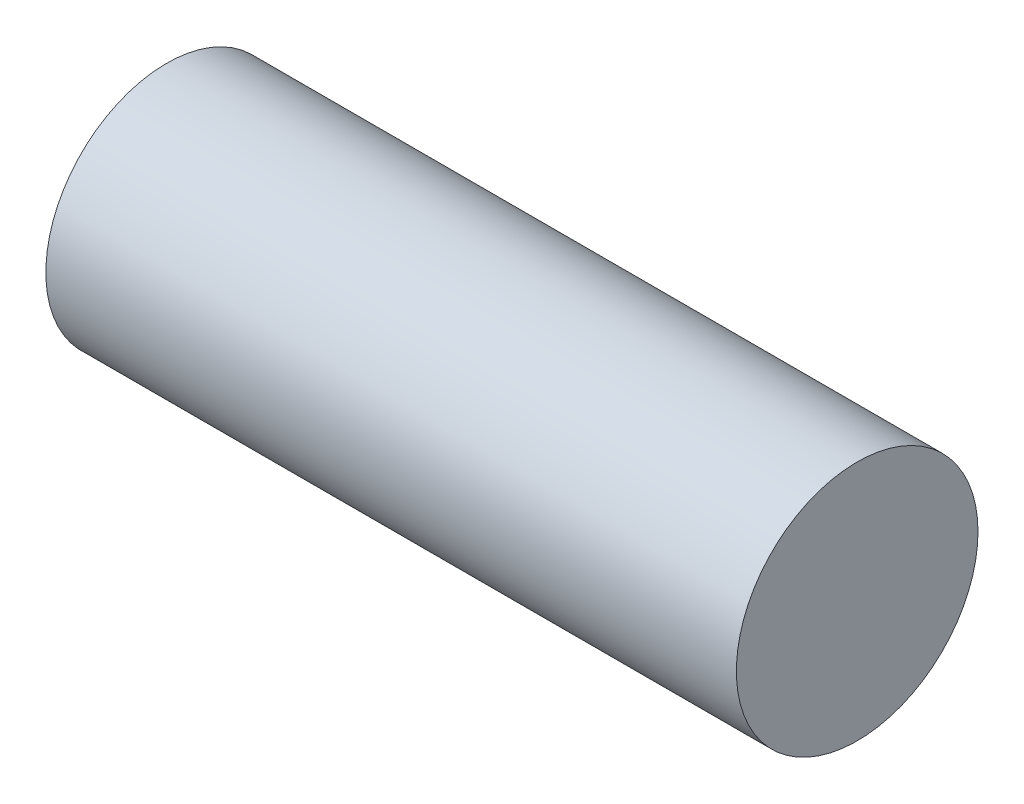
from build123d import *

# Parameters (mm, degrees)
SKETCH1_R           = 5
BOSS_EXTRUDE1_DEPTH = 28.58


with BuildPart() as part:
    # Sketch1 → Boss-Extrude1 (new body)
    with BuildSketch(Plane(origin=(0, 0, 0), x_dir=(0, 0, -1), z_dir=(1, 0, 0))):
        Circle(SKETCH1_R)
    extrude(amount=BOSS_EXTRUDE1_DEPTH)


solid = part.part
